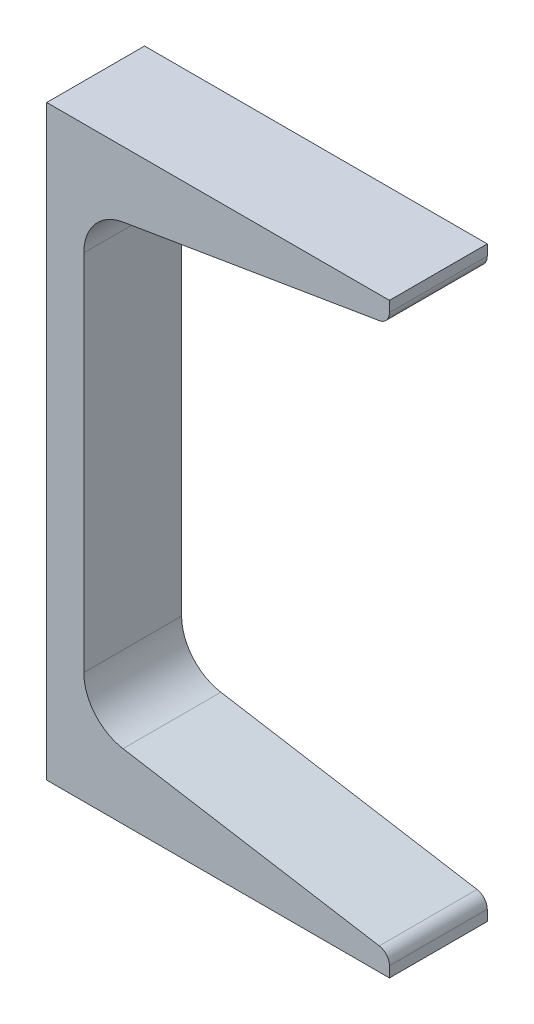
from build123d import *

# Parameters (mm, degrees)
BASEMCHANNEL_DEPTH = 12.7
TOEFILLET_R        = 3.175


with BuildPart() as part:
    # Sketch1 → BaseMchannel (new, symmetric)
    with BuildSketch(Plane.XY):
        with BuildLine():
            Line((89.0016, 152.4), (0, 152.4))
            Line((0, 152.4), (0, 0))
            Line((0, 0), (89.0016, 0))
            Line((89.0016, 0), (89.0016, 5.449934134))
            Line((89.0016, 5.449934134), (19.814105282, 16.982024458))
            ThreePointArc((19.814105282, 16.982024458), (12.515813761, 21.127567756), (9.6266, 29.008115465))
            Line((9.6266, 29.008115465), (9.6266, 123.391884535))
            ThreePointArc((9.6266, 123.391884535), (12.515813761, 131.272432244), (19.814105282, 135.417975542))
            Line((19.814105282, 135.417975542), (89.0016, 146.950065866))
            Line((89.0016, 146.950065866), (89.0016, 152.4))
        make_face()
    extrude(amount=BASEMCHANNEL_DEPTH, both=True)

    # ToeFillet
    toefillet_edges = [part.edges().sort_by_distance(p)[0] for p in [
        (89.0016, 146.950065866, 0),
        (89.0016, 5.449934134, 0),
    ]]
    fillet(toefillet_edges, radius=TOEFILLET_R)


solid = part.part
